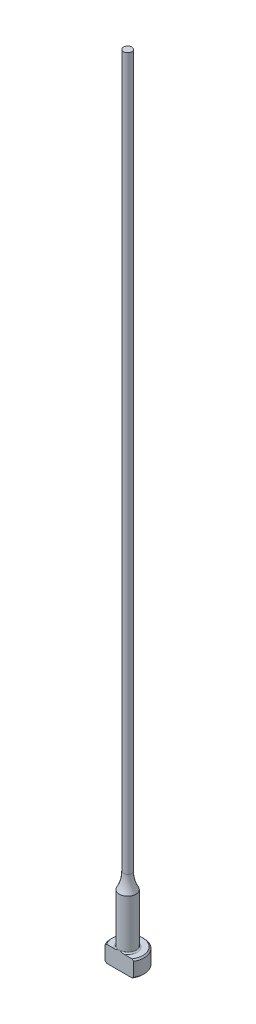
from build123d import *

# Parameters (mm, degrees)
CHAMFER1_SIZE = 0.254
FILLET1_R     = 0.254
KEY_DEPTH     = 153.466131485


with BuildPart() as part:
    # Sketch1 → Revolve1 (revolve)
    with BuildSketch(Plane.XY, mode=Mode.PRIVATE) as revolve1_sk:
        with BuildLine():
            Line((0, 0), (-3.175, 0))
            Line((-3.175, 0), (-3.175, 3.175))
            Line((-3.175, 3.175), (-1.5875, 3.175))
            Line((-1.5875, 3.175), (-1.5875, 12.7))
            ThreePointArc((-1.5875, 12.7), (-0.995388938, 14.186680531), (-0.79375, 15.774180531))
            Line((-0.79375, 15.774180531), (-0.79375, 152.4))
            Line((-0.79375, 152.4), (0, 152.4))
            Line((0, 152.4), (0, 0))
        make_face()
    revolve(revolve1_sk.sketch.rotate(Axis((0, 259.958771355, 0), (0, -1, 0)), 270), axis=Axis((0, 259.958771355, 0), (0, -1, 0)))

    # Chamfer1
    chamfer1_edges = [part.edges().sort_by_distance(p)[0] for p in [
        (0, 0, -3.175),
        (0, 3.175, -3.175),
    ]]
    chamfer(chamfer1_edges, length=CHAMFER1_SIZE)

    # Fillet1
    fillet1_edges = [part.edges().sort_by_distance(p)[0] for p in [
        (0, 3.175, -1.5875),
    ]]
    fillet(fillet1_edges, radius=FILLET1_R)

    # Sketch2 → KEY (cut, through all)
    with BuildSketch(Plane.XZ):
        with BuildLine():
            Line((-2.749630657, 1.5875), (2.749630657, 1.5875))
            ThreePointArc((2.749630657, 1.5875), (0, 3.175), (-2.749630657, 1.5875))
        make_face()
    extrude(amount=-KEY_DEPTH, mode=Mode.SUBTRACT)


solid = part.part
